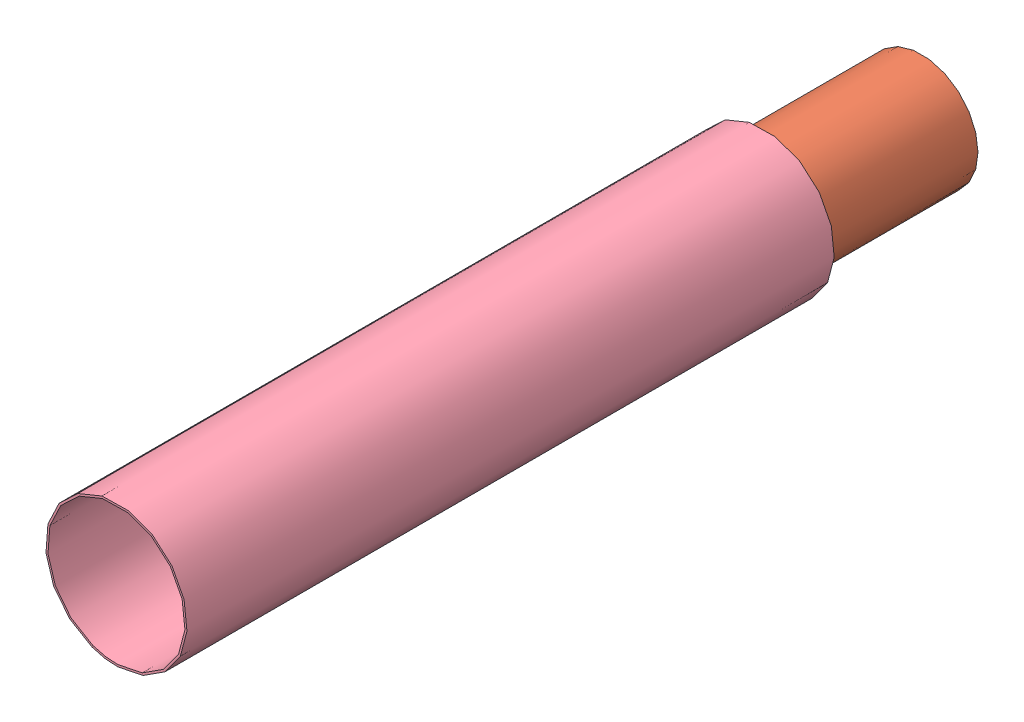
SolidWorks assembly Parachute Section.SLDASM, configuration Default (file format 3100). Lengths in mm.
Overall size (63.96 63.96 325.44).
7 component instances, 5 part files, 12 mates.
Components (placement in the parent):
- Coupler Bulkplate-1: Coupler Bulkplate.SLDPRT [Default] at (-9.3638 1.2192 4.1128) size (41.27 41.27 1.59)
- Coupler Bulkplate-2: Coupler Bulkplate.SLDPRT [Default] at (-9.3638 1.2192 4.1128) x (1 0 0) z (0 0 -1) size (41.27 41.27 1.59)
- Coupler Tube-1: Coupler Tube.SLDPRT [Default] at (-9.3638 1.2192 2.5253) size (44.45 44.45 101.6)
- Coupler Centering Ring-1: Coupler Centering Ring.SLDPRT [Default] at (-9.3638 1.2192 64.4378) size (53.98 53.98 1.59)
- Coupler Centering Ring-2: Coupler Centering Ring.SLDPRT [Default] at (-9.3638 1.2192 102.5378) size (53.98 53.98 1.59)
- Parachute Section Tube-1: Parachute Section Tube.SLDPRT [Default] at (-9.3638 1.2192 64.4378) x (-0.164855 -0.986318 0) z (0 0 1) size (55.56 55.56 254)
- Connector (pseudo)-1: Connector (pseudo).SLDPRT [Default] at (-24.6038 1.2192 5.7003) x (0.371632 0.92838 0) z (0 0 -1) size (9.53 9.53 12.7)
Mates (geometry in assembly coordinates):
- Concentric1: concentric aligned: cylinder of Coupler Tube-1; cylinder of Parachute Section Tube-1
- Concentric2: concentric aligned: circle of Coupler Bulkplate-1 centre (-9.3638 1.2192 4.1128) axis (0 0 1); circle of Coupler Tube-1 centre (-9.3638 1.2192 2.5253) axis (0 0 1)
- Coincident2: coincident anti-aligned: plane of Coupler Bulkplate-1 through (-9.3638 1.2192 4.1128) normal (0 0 -1); plane of Coupler Bulkplate-2 through (-9.3638 1.2192 4.1128) normal (0 0 1)
- Coincident3: coincident anti-aligned: circle of Coupler Bulkplate-2 centre (-9.3638 1.2192 2.5253) axis (0 0 -1); circle of Coupler Tube-1 centre (-9.3638 1.2192 2.5253) axis (0 0 1)
- Concentric3: concentric anti-aligned: circle of Coupler Bulkplate-1 centre (-24.6038 1.2192 4.1128) axis (0 0 1); circle of Coupler Bulkplate-2 centre (-24.6038 1.2192 2.5253) axis (0 0 -1)
- Concentric4: concentric aligned: cylinder of Coupler Tube-1; cylinder of Coupler Centering Ring-2
- Concentric5: concentric aligned: cylinder of Coupler Tube-1; cylinder of Coupler Centering Ring-1
- Coincident5: coincident aligned: plane of Coupler Tube-1 through (-9.3638 1.2192 104.1253) normal (0 0 1); plane of Coupler Centering Ring-2 through (-9.3638 1.2192 104.1253) normal (0 0 1)
- Distance1: distance = 38.1 mm aligned: plane of Coupler Centering Ring-1 through (-9.3638 1.2192 66.0253) normal (0 0 1); plane of Coupler Centering Ring-2 through (-9.3638 1.2192 104.1253) normal (0 0 1)
- Coincident7: coincident aligned: plane of Coupler Centering Ring-1 through (-9.3638 1.2192 64.4378) normal (0 0 -1); plane of Parachute Section Tube-1 through (-9.3638 1.2192 64.4378) normal (0 0 -1)
- Concentric6: concentric anti-aligned: cylinder of Coupler Bulkplate-1; cylinder of Connector (pseudo)-1
- Coincident8: coincident aligned: plane of Coupler Bulkplate-1 through (-9.3638 1.2192 5.7003) normal (0 0 1); plane of Connector (pseudo)-1 through (-24.6038 1.2192 5.7003) normal (0 0 1)
